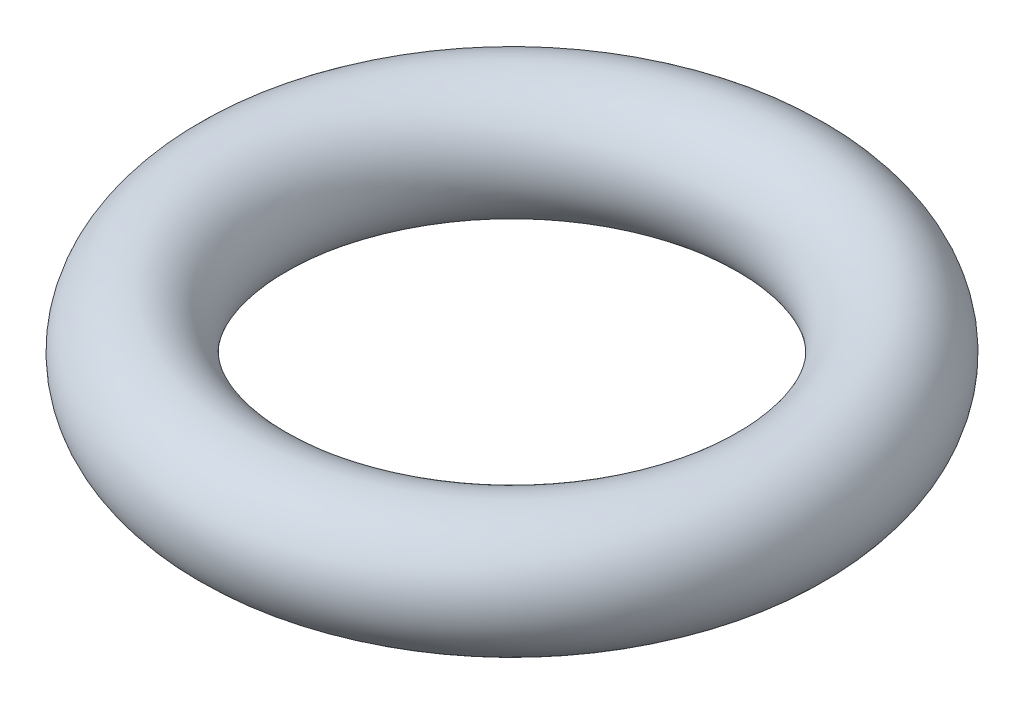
ISO-10303-21;
HEADER;
FILE_DESCRIPTION(('STEP AP214'),'2;1');
FILE_NAME('part.step','',(''),(''),'','','');
FILE_SCHEMA(('AUTOMOTIVE_DESIGN { 1 0 10303 214 1 1 1 1 }'));
ENDSEC;
DATA;
#1=APPLICATION_CONTEXT('core data for automotive mechanical design processes');
#2=APPLICATION_PROTOCOL_DEFINITION('international standard','automotive_design',2000,#1);
#3=PRODUCT_CONTEXT('',#1,'mechanical');
#4=PRODUCT('Part','Part','',(#3));
#5=PRODUCT_RELATED_PRODUCT_CATEGORY('part','',(#4));
#6=PRODUCT_DEFINITION_FORMATION('','',#4);
#7=PRODUCT_DEFINITION_CONTEXT('part definition',#1,'design');
#8=PRODUCT_DEFINITION('design','',#6,#7);
#9=PRODUCT_DEFINITION_SHAPE('','',#8);
#10=(LENGTH_UNIT() NAMED_UNIT(*) SI_UNIT(.MILLI.,.METRE.));
#11=(NAMED_UNIT(*) PLANE_ANGLE_UNIT() SI_UNIT($,.RADIAN.));
#12=(NAMED_UNIT(*) SI_UNIT($,.STERADIAN.) SOLID_ANGLE_UNIT());
#13=UNCERTAINTY_MEASURE_WITH_UNIT(LENGTH_MEASURE(1.E-05),#10,'distance_accuracy_value','');
#14=(GEOMETRIC_REPRESENTATION_CONTEXT(3) GLOBAL_UNCERTAINTY_ASSIGNED_CONTEXT((#13)) GLOBAL_UNIT_ASSIGNED_CONTEXT((#10,
#11,#12)) REPRESENTATION_CONTEXT('',''));
#15=CARTESIAN_POINT('',(0.,0.,0.));
#16=DIRECTION('',(0.,0.,1.));
#17=DIRECTION('',(1.,0.,0.));
#18=AXIS2_PLACEMENT_3D('',#15,#16,#17);
#19=CARTESIAN_POINT('',(0.,0.,0.));
#20=DIRECTION('',(0.,-1.,0.));
#21=DIRECTION('',(0.,0.,-1.));
#22=AXIS2_PLACEMENT_3D('',#19,#20,#21);
#23=TOROIDAL_SURFACE('',#22,3.925,0.890000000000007);
#24=CARTESIAN_POINT('',(0.,0.,-4.815));
#25=VERTEX_POINT('',#24);
#26=VERTEX_LOOP('',#25);
#27=FACE_BOUND('',#26,.T.);
#28=ADVANCED_FACE('F34',(#27),#23,.T.);
#29=CLOSED_SHELL('',(#28));
#30=MANIFOLD_SOLID_BREP('B2',#29);
#31=ADVANCED_BREP_SHAPE_REPRESENTATION('',(#18,#30),#14);
#32=SHAPE_DEFINITION_REPRESENTATION(#9,#31);
ENDSEC;
END-ISO-10303-21;
